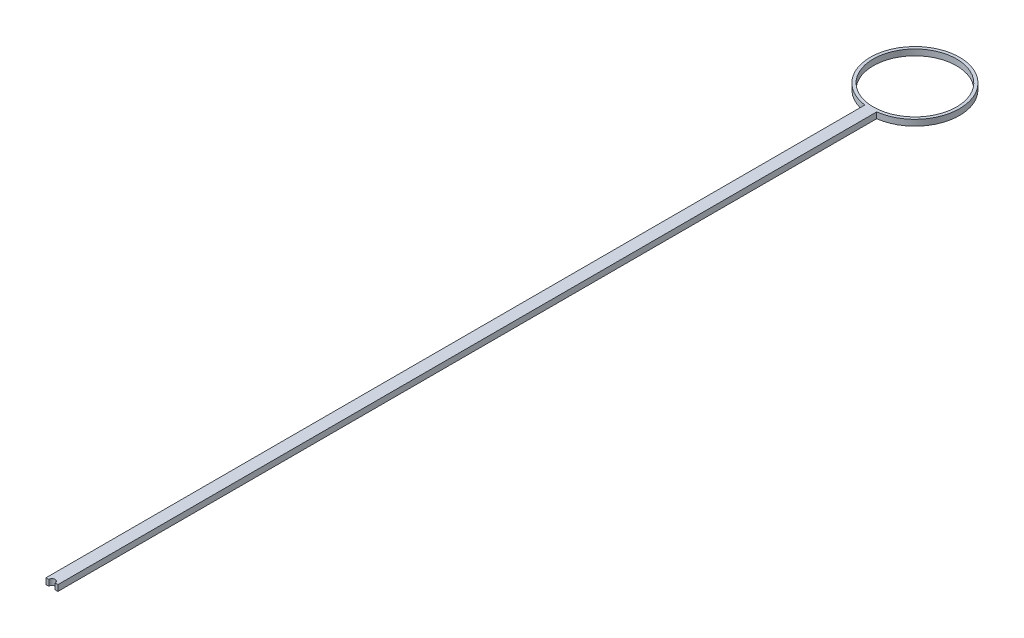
ISO-10303-21;
HEADER;
FILE_DESCRIPTION(('STEP AP214'),'2;1');
FILE_NAME('part.step','',(''),(''),'','','');
FILE_SCHEMA(('AUTOMOTIVE_DESIGN { 1 0 10303 214 1 1 1 1 }'));
ENDSEC;
DATA;
#1=APPLICATION_CONTEXT('core data for automotive mechanical design processes');
#2=APPLICATION_PROTOCOL_DEFINITION('international standard','automotive_design',2000,#1);
#3=PRODUCT_CONTEXT('',#1,'mechanical');
#4=PRODUCT('Part','Part','',(#3));
#5=PRODUCT_RELATED_PRODUCT_CATEGORY('part','',(#4));
#6=PRODUCT_DEFINITION_FORMATION('','',#4);
#7=PRODUCT_DEFINITION_CONTEXT('part definition',#1,'design');
#8=PRODUCT_DEFINITION('design','',#6,#7);
#9=PRODUCT_DEFINITION_SHAPE('','',#8);
#10=(LENGTH_UNIT() NAMED_UNIT(*) SI_UNIT(.MILLI.,.METRE.));
#11=(NAMED_UNIT(*) PLANE_ANGLE_UNIT() SI_UNIT($,.RADIAN.));
#12=(NAMED_UNIT(*) SI_UNIT($,.STERADIAN.) SOLID_ANGLE_UNIT());
#13=UNCERTAINTY_MEASURE_WITH_UNIT(LENGTH_MEASURE(1.E-05),#10,'distance_accuracy_value','');
#14=(GEOMETRIC_REPRESENTATION_CONTEXT(3) GLOBAL_UNCERTAINTY_ASSIGNED_CONTEXT((#13)) GLOBAL_UNIT_ASSIGNED_CONTEXT((#10,
#11,#12)) REPRESENTATION_CONTEXT('',''));
#15=CARTESIAN_POINT('',(0.,0.,0.));
#16=DIRECTION('',(0.,0.,1.));
#17=DIRECTION('',(1.,0.,0.));
#18=AXIS2_PLACEMENT_3D('',#15,#16,#17);
#19=CARTESIAN_POINT('',(0.,20.,-2902.3));
#20=DIRECTION('',(0.,1.,0.));
#21=DIRECTION('',(0.,0.,1.));
#22=AXIS2_PLACEMENT_3D('',#19,#20,#21);
#23=PLANE('',#22);
#24=CARTESIAN_POINT('',(0.,20.,-2902.3));
#25=DIRECTION('',(0.,1.,0.));
#26=DIRECTION('',(0.,0.,1.));
#27=AXIS2_PLACEMENT_3D('',#24,#25,#26);
#28=CIRCLE('',#27,150.);
#29=CARTESIAN_POINT('',(20.,20.,-2753.63931252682));
#30=VERTEX_POINT('',#29);
#31=CARTESIAN_POINT('',(-20.,20.,-2753.63931252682));
#32=VERTEX_POINT('',#31);
#33=EDGE_CURVE('E154',#30,#32,#28,.T.);
#34=ORIENTED_EDGE('',*,*,#33,.T.);
#35=DIRECTION('',(0.,0.,1.));
#36=VECTOR('',#35,1.);
#37=CARTESIAN_POINT('',(-20.,20.,-2753.63931252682));
#38=LINE('',#37,#36);
#39=CARTESIAN_POINT('',(-20.,20.,1.11022302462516E-13));
#40=VERTEX_POINT('',#39);
#41=EDGE_CURVE('E100',#32,#40,#38,.T.);
#42=ORIENTED_EDGE('',*,*,#41,.T.);
#43=DIRECTION('',(1.,0.,0.));
#44=VECTOR('',#43,1.);
#45=CARTESIAN_POINT('',(-20.,20.,1.11022302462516E-13));
#46=LINE('',#45,#44);
#47=CARTESIAN_POINT('',(-10.704852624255,20.,1.11022302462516E-13));
#48=VERTEX_POINT('',#47);
#49=EDGE_CURVE('E115',#40,#48,#46,.T.);
#50=ORIENTED_EDGE('',*,*,#49,.T.);
#51=CARTESIAN_POINT('',(0.,20.,0.));
#52=DIRECTION('',(0.,-1.,0.));
#53=DIRECTION('',(0.,0.,1.));
#54=AXIS2_PLACEMENT_3D('',#51,#52,#53);
#55=CIRCLE('',#54,10.704852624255);
#56=CARTESIAN_POINT('',(10.704852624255,20.,1.09995402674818E-13));
#57=VERTEX_POINT('',#56);
#58=EDGE_CURVE('E109',#48,#57,#55,.T.);
#59=ORIENTED_EDGE('',*,*,#58,.T.);
#60=DIRECTION('',(1.,0.,0.));
#61=VECTOR('',#60,1.);
#62=CARTESIAN_POINT('',(10.704852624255,20.,1.11022302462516E-13));
#63=LINE('',#62,#61);
#64=CARTESIAN_POINT('',(20.,20.,1.11022302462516E-13));
#65=VERTEX_POINT('',#64);
#66=EDGE_CURVE('E113',#57,#65,#63,.T.);
#67=ORIENTED_EDGE('',*,*,#66,.T.);
#68=DIRECTION('',(0.,0.,-1.));
#69=VECTOR('',#68,1.);
#70=CARTESIAN_POINT('',(20.,20.,-2753.63931252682));
#71=LINE('',#70,#69);
#72=EDGE_CURVE('E57',#65,#30,#71,.T.);
#73=ORIENTED_EDGE('',*,*,#72,.T.);
#74=EDGE_LOOP('',(#34,#42,#50,#59,#67,#73));
#75=FACE_BOUND('',#74,.T.);
#76=CARTESIAN_POINT('',(0.,20.,-2902.3));
#77=DIRECTION('',(0.,1.,0.));
#78=DIRECTION('',(0.,0.,1.));
#79=AXIS2_PLACEMENT_3D('',#76,#77,#78);
#80=CIRCLE('',#79,140.);
#81=CARTESIAN_POINT('',(0.,20.,-2762.3));
#82=VERTEX_POINT('',#81);
#83=EDGE_CURVE('E142',#82,#82,#80,.T.);
#84=ORIENTED_EDGE('',*,*,#83,.F.);
#85=EDGE_LOOP('',(#84));
#86=FACE_BOUND('',#85,.T.);
#87=ADVANCED_FACE('F40',(#75,#86),#23,.T.);
#88=CARTESIAN_POINT('',(0.,0.,-2902.3));
#89=DIRECTION('',(0.,1.,0.));
#90=DIRECTION('',(0.,0.,1.));
#91=AXIS2_PLACEMENT_3D('',#88,#89,#90);
#92=PLANE('',#91);
#93=CARTESIAN_POINT('',(0.,0.,-2902.3));
#94=DIRECTION('',(0.,1.,0.));
#95=DIRECTION('',(0.,0.,1.));
#96=AXIS2_PLACEMENT_3D('',#93,#94,#95);
#97=CIRCLE('',#96,150.);
#98=CARTESIAN_POINT('',(20.,0.,-2753.63931252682));
#99=VERTEX_POINT('',#98);
#100=CARTESIAN_POINT('',(-20.,0.,-2753.63931252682));
#101=VERTEX_POINT('',#100);
#102=EDGE_CURVE('E138',#99,#101,#97,.T.);
#103=ORIENTED_EDGE('',*,*,#102,.F.);
#104=DIRECTION('',(0.,0.,-1.));
#105=VECTOR('',#104,1.);
#106=CARTESIAN_POINT('',(20.,0.,-2753.63931252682));
#107=LINE('',#106,#105);
#108=CARTESIAN_POINT('',(20.,0.,1.11022302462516E-13));
#109=VERTEX_POINT('',#108);
#110=EDGE_CURVE('E92',#109,#99,#107,.T.);
#111=ORIENTED_EDGE('',*,*,#110,.F.);
#112=DIRECTION('',(1.,0.,0.));
#113=VECTOR('',#112,1.);
#114=CARTESIAN_POINT('',(10.704852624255,0.,1.11022302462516E-13));
#115=LINE('',#114,#113);
#116=CARTESIAN_POINT('',(10.704852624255,0.,1.09995402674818E-13));
#117=VERTEX_POINT('',#116);
#118=EDGE_CURVE('E86',#117,#109,#115,.T.);
#119=ORIENTED_EDGE('',*,*,#118,.F.);
#120=CARTESIAN_POINT('',(0.,0.,0.));
#121=DIRECTION('',(0.,-1.,0.));
#122=DIRECTION('',(0.,0.,1.));
#123=AXIS2_PLACEMENT_3D('',#120,#121,#122);
#124=CIRCLE('',#123,10.704852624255);
#125=CARTESIAN_POINT('',(-10.704852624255,0.,1.11022302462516E-13));
#126=VERTEX_POINT('',#125);
#127=EDGE_CURVE('E124',#126,#117,#124,.T.);
#128=ORIENTED_EDGE('',*,*,#127,.F.);
#129=DIRECTION('',(1.,0.,0.));
#130=VECTOR('',#129,1.);
#131=CARTESIAN_POINT('',(-20.,0.,1.11022302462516E-13));
#132=LINE('',#131,#130);
#133=CARTESIAN_POINT('',(-20.,0.,1.11022302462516E-13));
#134=VERTEX_POINT('',#133);
#135=EDGE_CURVE('E145',#134,#126,#132,.T.);
#136=ORIENTED_EDGE('',*,*,#135,.F.);
#137=DIRECTION('',(0.,0.,1.));
#138=VECTOR('',#137,1.);
#139=CARTESIAN_POINT('',(-20.,0.,-2753.63931252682));
#140=LINE('',#139,#138);
#141=EDGE_CURVE('E141',#101,#134,#140,.T.);
#142=ORIENTED_EDGE('',*,*,#141,.F.);
#143=EDGE_LOOP('',(#103,#111,#119,#128,#136,#142));
#144=FACE_BOUND('',#143,.T.);
#145=CARTESIAN_POINT('',(0.,0.,-2902.3));
#146=DIRECTION('',(0.,1.,0.));
#147=DIRECTION('',(0.,0.,1.));
#148=AXIS2_PLACEMENT_3D('',#145,#146,#147);
#149=CIRCLE('',#148,140.);
#150=CARTESIAN_POINT('',(0.,0.,-2762.3));
#151=VERTEX_POINT('',#150);
#152=EDGE_CURVE('E252',#151,#151,#149,.T.);
#153=ORIENTED_EDGE('',*,*,#152,.T.);
#154=EDGE_LOOP('',(#153));
#155=FACE_BOUND('',#154,.T.);
#156=ADVANCED_FACE('F166',(#144,#155),#92,.F.);
#157=CARTESIAN_POINT('',(0.,20.,-2902.3));
#158=DIRECTION('',(0.,-1.,0.));
#159=DIRECTION('',(0.,0.,-1.));
#160=AXIS2_PLACEMENT_3D('',#157,#158,#159);
#161=CYLINDRICAL_SURFACE('',#160,150.);
#162=ORIENTED_EDGE('',*,*,#102,.T.);
#163=DIRECTION('',(0.,-1.,0.));
#164=VECTOR('',#163,1.);
#165=CARTESIAN_POINT('',(-20.,20.,-2753.63931252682));
#166=LINE('',#165,#164);
#167=EDGE_CURVE('E11',#32,#101,#166,.T.);
#168=ORIENTED_EDGE('',*,*,#167,.F.);
#169=ORIENTED_EDGE('',*,*,#33,.F.);
#170=DIRECTION('',(0.,-1.,0.));
#171=VECTOR('',#170,1.);
#172=CARTESIAN_POINT('',(20.,20.,-2753.63931252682));
#173=LINE('',#172,#171);
#174=EDGE_CURVE('E134',#30,#99,#173,.T.);
#175=ORIENTED_EDGE('',*,*,#174,.T.);
#176=EDGE_LOOP('',(#162,#168,#169,#175));
#177=FACE_BOUND('',#176,.T.);
#178=ADVANCED_FACE('F42',(#177),#161,.T.);
#179=CARTESIAN_POINT('',(-20.,20.,-2753.63931252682));
#180=DIRECTION('',(1.,0.,0.));
#181=DIRECTION('',(0.,0.,-1.));
#182=AXIS2_PLACEMENT_3D('',#179,#180,#181);
#183=PLANE('',#182);
#184=ORIENTED_EDGE('',*,*,#141,.T.);
#185=DIRECTION('',(0.,-1.,0.));
#186=VECTOR('',#185,1.);
#187=CARTESIAN_POINT('',(-20.,20.,1.11022302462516E-13));
#188=LINE('',#187,#186);
#189=EDGE_CURVE('E49',#40,#134,#188,.T.);
#190=ORIENTED_EDGE('',*,*,#189,.F.);
#191=ORIENTED_EDGE('',*,*,#41,.F.);
#192=ORIENTED_EDGE('',*,*,#167,.T.);
#193=EDGE_LOOP('',(#184,#190,#191,#192));
#194=FACE_BOUND('',#193,.T.);
#195=ADVANCED_FACE('F191',(#194),#183,.F.);
#196=CARTESIAN_POINT('',(-20.,20.,1.11022302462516E-13));
#197=DIRECTION('',(0.,0.,-1.));
#198=DIRECTION('',(-1.,0.,0.));
#199=AXIS2_PLACEMENT_3D('',#196,#197,#198);
#200=PLANE('',#199);
#201=ORIENTED_EDGE('',*,*,#135,.T.);
#202=DIRECTION('',(0.,-1.,0.));
#203=VECTOR('',#202,1.);
#204=CARTESIAN_POINT('',(-10.704852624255,20.,1.11022302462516E-13));
#205=LINE('',#204,#203);
#206=EDGE_CURVE('E126',#48,#126,#205,.T.);
#207=ORIENTED_EDGE('',*,*,#206,.F.);
#208=ORIENTED_EDGE('',*,*,#49,.F.);
#209=ORIENTED_EDGE('',*,*,#189,.T.);
#210=EDGE_LOOP('',(#201,#207,#208,#209));
#211=FACE_BOUND('',#210,.T.);
#212=ADVANCED_FACE('F163',(#211),#200,.F.);
#213=CARTESIAN_POINT('',(0.,20.,0.));
#214=DIRECTION('',(0.,-1.,0.));
#215=DIRECTION('',(0.,0.,-1.));
#216=AXIS2_PLACEMENT_3D('',#213,#214,#215);
#217=CYLINDRICAL_SURFACE('',#216,10.704852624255);
#218=ORIENTED_EDGE('',*,*,#127,.T.);
#219=DIRECTION('',(0.,-1.,0.));
#220=VECTOR('',#219,1.);
#221=CARTESIAN_POINT('',(10.704852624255,20.,1.09995402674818E-13));
#222=LINE('',#221,#220);
#223=EDGE_CURVE('E121',#57,#117,#222,.T.);
#224=ORIENTED_EDGE('',*,*,#223,.F.);
#225=ORIENTED_EDGE('',*,*,#58,.F.);
#226=ORIENTED_EDGE('',*,*,#206,.T.);
#227=EDGE_LOOP('',(#218,#224,#225,#226));
#228=FACE_BOUND('',#227,.T.);
#229=ADVANCED_FACE('F122',(#228),#217,.F.);
#230=CARTESIAN_POINT('',(10.704852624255,20.,1.11022302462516E-13));
#231=DIRECTION('',(0.,0.,-1.));
#232=DIRECTION('',(-1.,0.,0.));
#233=AXIS2_PLACEMENT_3D('',#230,#231,#232);
#234=PLANE('',#233);
#235=ORIENTED_EDGE('',*,*,#118,.T.);
#236=DIRECTION('',(0.,-1.,0.));
#237=VECTOR('',#236,1.);
#238=CARTESIAN_POINT('',(20.,20.,1.11022302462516E-13));
#239=LINE('',#238,#237);
#240=EDGE_CURVE('E127',#65,#109,#239,.T.);
#241=ORIENTED_EDGE('',*,*,#240,.F.);
#242=ORIENTED_EDGE('',*,*,#66,.F.);
#243=ORIENTED_EDGE('',*,*,#223,.T.);
#244=EDGE_LOOP('',(#235,#241,#242,#243));
#245=FACE_BOUND('',#244,.T.);
#246=ADVANCED_FACE('F129',(#245),#234,.F.);
#247=CARTESIAN_POINT('',(20.,20.,-2753.63931252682));
#248=DIRECTION('',(-1.,0.,0.));
#249=DIRECTION('',(0.,0.,1.));
#250=AXIS2_PLACEMENT_3D('',#247,#248,#249);
#251=PLANE('',#250);
#252=ORIENTED_EDGE('',*,*,#110,.T.);
#253=ORIENTED_EDGE('',*,*,#174,.F.);
#254=ORIENTED_EDGE('',*,*,#72,.F.);
#255=ORIENTED_EDGE('',*,*,#240,.T.);
#256=EDGE_LOOP('',(#252,#253,#254,#255));
#257=FACE_BOUND('',#256,.T.);
#258=ADVANCED_FACE('F171',(#257),#251,.F.);
#259=CARTESIAN_POINT('',(0.,20.,-2902.3));
#260=DIRECTION('',(0.,-1.,0.));
#261=DIRECTION('',(0.,0.,-1.));
#262=AXIS2_PLACEMENT_3D('',#259,#260,#261);
#263=CYLINDRICAL_SURFACE('',#262,140.);
#264=ORIENTED_EDGE('',*,*,#83,.T.);
#265=EDGE_LOOP('',(#264));
#266=FACE_BOUND('',#265,.T.);
#267=ORIENTED_EDGE('',*,*,#152,.F.);
#268=EDGE_LOOP('',(#267));
#269=FACE_BOUND('',#268,.T.);
#270=ADVANCED_FACE('F173',(#266,#269),#263,.F.);
#271=CLOSED_SHELL('',(#87,#156,#178,#195,#212,#229,#246,#258,#270));
#272=MANIFOLD_SOLID_BREP('B2',#271);
#273=ADVANCED_BREP_SHAPE_REPRESENTATION('',(#18,#272),#14);
#274=SHAPE_DEFINITION_REPRESENTATION(#9,#273);
ENDSEC;
END-ISO-10303-21;
